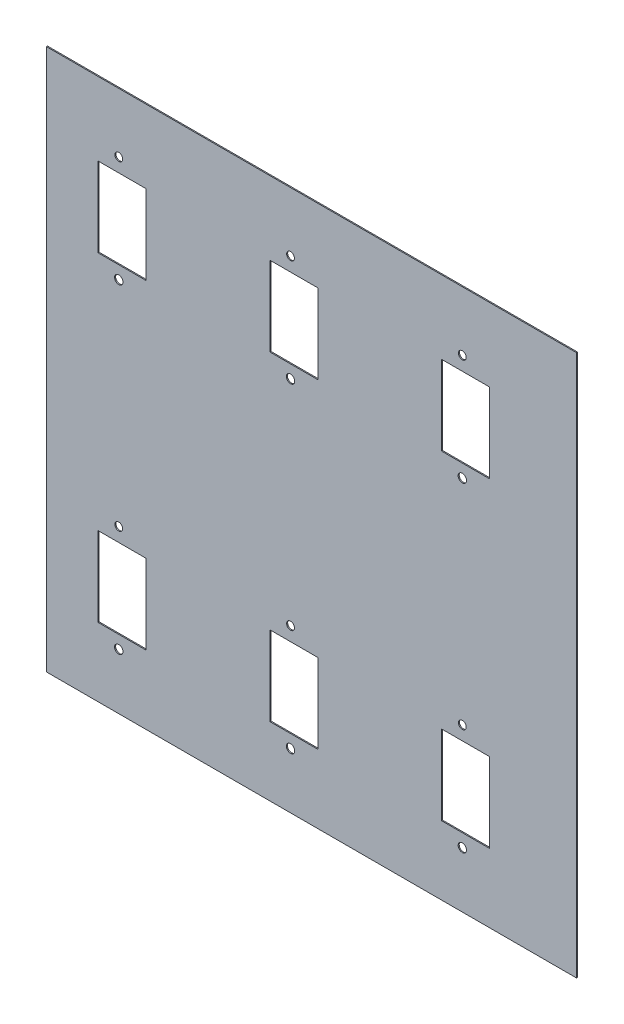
ISO-10303-21;
HEADER;
FILE_DESCRIPTION(('STEP AP214'),'2;1');
FILE_NAME('part.step','',(''),(''),'','','');
FILE_SCHEMA(('AUTOMOTIVE_DESIGN { 1 0 10303 214 1 1 1 1 }'));
ENDSEC;
DATA;
#1=APPLICATION_CONTEXT('core data for automotive mechanical design processes');
#2=APPLICATION_PROTOCOL_DEFINITION('international standard','automotive_design',2000,#1);
#3=PRODUCT_CONTEXT('',#1,'mechanical');
#4=PRODUCT('Part','Part','',(#3));
#5=PRODUCT_RELATED_PRODUCT_CATEGORY('part','',(#4));
#6=PRODUCT_DEFINITION_FORMATION('','',#4);
#7=PRODUCT_DEFINITION_CONTEXT('part definition',#1,'design');
#8=PRODUCT_DEFINITION('design','',#6,#7);
#9=PRODUCT_DEFINITION_SHAPE('','',#8);
#10=(LENGTH_UNIT() NAMED_UNIT(*) SI_UNIT(.MILLI.,.METRE.));
#11=(NAMED_UNIT(*) PLANE_ANGLE_UNIT() SI_UNIT($,.RADIAN.));
#12=(NAMED_UNIT(*) SI_UNIT($,.STERADIAN.) SOLID_ANGLE_UNIT());
#13=UNCERTAINTY_MEASURE_WITH_UNIT(LENGTH_MEASURE(1.E-05),#10,'distance_accuracy_value','');
#14=(GEOMETRIC_REPRESENTATION_CONTEXT(3) GLOBAL_UNCERTAINTY_ASSIGNED_CONTEXT((#13)) GLOBAL_UNIT_ASSIGNED_CONTEXT((#10,
#11,#12)) REPRESENTATION_CONTEXT('',''));
#15=CARTESIAN_POINT('',(0.,0.,0.));
#16=DIRECTION('',(0.,0.,1.));
#17=DIRECTION('',(1.,0.,0.));
#18=AXIS2_PLACEMENT_3D('',#15,#16,#17);
#19=CARTESIAN_POINT('',(-292.934613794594,286.400756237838,2.54));
#20=DIRECTION('',(1.,0.,0.));
#21=DIRECTION('',(0.,0.,-1.));
#22=AXIS2_PLACEMENT_3D('',#19,#20,#21);
#23=PLANE('',#22);
#24=DIRECTION('',(0.,-1.,0.));
#25=VECTOR('',#24,1.);
#26=CARTESIAN_POINT('',(-292.934613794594,286.400756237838,0.));
#27=LINE('',#26,#25);
#28=CARTESIAN_POINT('',(-292.934613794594,286.400756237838,0.));
#29=VERTEX_POINT('',#28);
#30=CARTESIAN_POINT('',(-292.934613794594,-1002.79142159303,0.));
#31=VERTEX_POINT('',#30);
#32=EDGE_CURVE('E297',#29,#31,#27,.T.);
#33=ORIENTED_EDGE('',*,*,#32,.T.);
#34=DIRECTION('',(0.,0.,-1.));
#35=VECTOR('',#34,1.);
#36=CARTESIAN_POINT('',(-292.934613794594,-1002.79142159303,2.54));
#37=LINE('',#36,#35);
#38=CARTESIAN_POINT('',(-292.934613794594,-1002.79142159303,2.54));
#39=VERTEX_POINT('',#38);
#40=EDGE_CURVE('E330',#39,#31,#37,.T.);
#41=ORIENTED_EDGE('',*,*,#40,.F.);
#42=DIRECTION('',(0.,-1.,0.));
#43=VECTOR('',#42,1.);
#44=CARTESIAN_POINT('',(-292.934613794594,286.400756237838,2.54));
#45=LINE('',#44,#43);
#46=CARTESIAN_POINT('',(-292.934613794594,286.400756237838,2.54));
#47=VERTEX_POINT('',#46);
#48=EDGE_CURVE('E304',#47,#39,#45,.T.);
#49=ORIENTED_EDGE('',*,*,#48,.F.);
#50=DIRECTION('',(0.,0.,-1.));
#51=VECTOR('',#50,1.);
#52=CARTESIAN_POINT('',(-292.934613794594,286.400756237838,2.54));
#53=LINE('',#52,#51);
#54=EDGE_CURVE('E314',#47,#29,#53,.T.);
#55=ORIENTED_EDGE('',*,*,#54,.T.);
#56=EDGE_LOOP('',(#33,#41,#49,#55));
#57=FACE_BOUND('',#56,.T.);
#58=ADVANCED_FACE('F30',(#57),#23,.F.);
#59=CARTESIAN_POINT('',(-292.934613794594,-1002.79142159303,2.54));
#60=DIRECTION('',(0.,1.,0.));
#61=DIRECTION('',(0.,0.,1.));
#62=AXIS2_PLACEMENT_3D('',#59,#60,#61);
#63=PLANE('',#62);
#64=DIRECTION('',(1.,0.,0.));
#65=VECTOR('',#64,1.);
#66=CARTESIAN_POINT('',(-292.934613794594,-1002.79142159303,0.));
#67=LINE('',#66,#65);
#68=CARTESIAN_POINT('',(969.034750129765,-1002.79142159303,0.));
#69=VERTEX_POINT('',#68);
#70=EDGE_CURVE('E317',#31,#69,#67,.T.);
#71=ORIENTED_EDGE('',*,*,#70,.T.);
#72=DIRECTION('',(0.,0.,-1.));
#73=VECTOR('',#72,1.);
#74=CARTESIAN_POINT('',(969.034750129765,-1002.79142159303,2.54));
#75=LINE('',#74,#73);
#76=CARTESIAN_POINT('',(969.034750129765,-1002.79142159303,2.54));
#77=VERTEX_POINT('',#76);
#78=EDGE_CURVE('E327',#77,#69,#75,.T.);
#79=ORIENTED_EDGE('',*,*,#78,.F.);
#80=DIRECTION('',(1.,0.,0.));
#81=VECTOR('',#80,1.);
#82=CARTESIAN_POINT('',(-292.934613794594,-1002.79142159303,2.54));
#83=LINE('',#82,#81);
#84=EDGE_CURVE('E307',#39,#77,#83,.T.);
#85=ORIENTED_EDGE('',*,*,#84,.F.);
#86=ORIENTED_EDGE('',*,*,#40,.T.);
#87=EDGE_LOOP('',(#71,#79,#85,#86));
#88=FACE_BOUND('',#87,.T.);
#89=ADVANCED_FACE('F476',(#88),#63,.F.);
#90=CARTESIAN_POINT('',(969.034750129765,286.400756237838,2.54));
#91=DIRECTION('',(-1.,0.,0.));
#92=DIRECTION('',(0.,-1.,0.));
#93=AXIS2_PLACEMENT_3D('',#90,#91,#92);
#94=PLANE('',#93);
#95=DIRECTION('',(0.,1.,0.));
#96=VECTOR('',#95,1.);
#97=CARTESIAN_POINT('',(969.034750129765,286.400756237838,0.));
#98=LINE('',#97,#96);
#99=CARTESIAN_POINT('',(969.034750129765,286.400756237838,0.));
#100=VERTEX_POINT('',#99);
#101=EDGE_CURVE('E319',#69,#100,#98,.T.);
#102=ORIENTED_EDGE('',*,*,#101,.T.);
#103=DIRECTION('',(0.,0.,-1.));
#104=VECTOR('',#103,1.);
#105=CARTESIAN_POINT('',(969.034750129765,286.400756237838,2.54));
#106=LINE('',#105,#104);
#107=CARTESIAN_POINT('',(969.034750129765,286.400756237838,2.54));
#108=VERTEX_POINT('',#107);
#109=EDGE_CURVE('E324',#108,#100,#106,.T.);
#110=ORIENTED_EDGE('',*,*,#109,.F.);
#111=DIRECTION('',(0.,1.,0.));
#112=VECTOR('',#111,1.);
#113=CARTESIAN_POINT('',(969.034750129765,286.400756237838,2.54));
#114=LINE('',#113,#112);
#115=EDGE_CURVE('E310',#77,#108,#114,.T.);
#116=ORIENTED_EDGE('',*,*,#115,.F.);
#117=ORIENTED_EDGE('',*,*,#78,.T.);
#118=EDGE_LOOP('',(#102,#110,#116,#117));
#119=FACE_BOUND('',#118,.T.);
#120=ADVANCED_FACE('F482',(#119),#94,.F.);
#121=CARTESIAN_POINT('',(-292.934613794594,286.400756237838,2.54));
#122=DIRECTION('',(0.,-1.,0.));
#123=DIRECTION('',(0.,0.,-1.));
#124=AXIS2_PLACEMENT_3D('',#121,#122,#123);
#125=PLANE('',#124);
#126=DIRECTION('',(-1.,0.,0.));
#127=VECTOR('',#126,1.);
#128=CARTESIAN_POINT('',(-292.934613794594,286.400756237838,0.));
#129=LINE('',#128,#127);
#130=EDGE_CURVE('E308',#100,#29,#129,.T.);
#131=ORIENTED_EDGE('',*,*,#130,.T.);
#132=ORIENTED_EDGE('',*,*,#54,.F.);
#133=DIRECTION('',(-1.,0.,0.));
#134=VECTOR('',#133,1.);
#135=CARTESIAN_POINT('',(-292.934613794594,286.400756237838,2.54));
#136=LINE('',#135,#134);
#137=EDGE_CURVE('E312',#108,#47,#136,.T.);
#138=ORIENTED_EDGE('',*,*,#137,.F.);
#139=ORIENTED_EDGE('',*,*,#109,.T.);
#140=EDGE_LOOP('',(#131,#132,#138,#139));
#141=FACE_BOUND('',#140,.T.);
#142=ADVANCED_FACE('F548',(#141),#125,.F.);
#143=CARTESIAN_POINT('',(-292.934613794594,-1002.79142159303,2.54));
#144=DIRECTION('',(0.,0.,1.));
#145=DIRECTION('',(1.,0.,0.));
#146=AXIS2_PLACEMENT_3D('',#143,#144,#145);
#147=PLANE('',#146);
#148=CARTESIAN_POINT('',(697.196630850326,-870.095305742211,2.54));
#149=DIRECTION('',(0.,0.,1.));
#150=DIRECTION('',(1.,0.,0.));
#151=AXIS2_PLACEMENT_3D('',#148,#149,#150);
#152=CIRCLE('',#151,9.95883906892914);
#153=CARTESIAN_POINT('',(707.155469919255,-870.095305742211,2.54));
#154=VERTEX_POINT('',#153);
#155=EDGE_CURVE('E906',#154,#154,#152,.T.);
#156=ORIENTED_EDGE('',*,*,#155,.F.);
#157=EDGE_LOOP('',(#156));
#158=FACE_BOUND('',#157,.T.);
#159=CARTESIAN_POINT('',(697.196630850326,-616.900953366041,2.54));
#160=DIRECTION('',(0.,0.,1.));
#161=DIRECTION('',(1.,0.,0.));
#162=AXIS2_PLACEMENT_3D('',#159,#160,#161);
#163=CIRCLE('',#162,9.33473781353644);
#164=CARTESIAN_POINT('',(706.531368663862,-616.900953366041,2.54));
#165=VERTEX_POINT('',#164);
#166=EDGE_CURVE('E908',#165,#165,#163,.T.);
#167=ORIENTED_EDGE('',*,*,#166,.F.);
#168=EDGE_LOOP('',(#167));
#169=FACE_BOUND('',#168,.T.);
#170=CARTESIAN_POINT('',(288.256630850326,-870.095305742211,2.54));
#171=DIRECTION('',(0.,0.,1.));
#172=DIRECTION('',(1.,0.,0.));
#173=AXIS2_PLACEMENT_3D('',#170,#171,#172);
#174=CIRCLE('',#173,9.95883906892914);
#175=CARTESIAN_POINT('',(298.215469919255,-870.095305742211,2.54));
#176=VERTEX_POINT('',#175);
#177=EDGE_CURVE('E914',#176,#176,#174,.T.);
#178=ORIENTED_EDGE('',*,*,#177,.F.);
#179=EDGE_LOOP('',(#178));
#180=FACE_BOUND('',#179,.T.);
#181=CARTESIAN_POINT('',(288.256630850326,-616.900953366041,2.54));
#182=DIRECTION('',(0.,0.,1.));
#183=DIRECTION('',(1.,0.,0.));
#184=AXIS2_PLACEMENT_3D('',#181,#182,#183);
#185=CIRCLE('',#184,9.33473781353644);
#186=CARTESIAN_POINT('',(297.591368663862,-616.900953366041,2.54));
#187=VERTEX_POINT('',#186);
#188=EDGE_CURVE('E920',#187,#187,#185,.T.);
#189=ORIENTED_EDGE('',*,*,#188,.F.);
#190=EDGE_LOOP('',(#189));
#191=FACE_BOUND('',#190,.T.);
#192=CARTESIAN_POINT('',(-120.683369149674,-870.095305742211,2.54));
#193=DIRECTION('',(0.,0.,1.));
#194=DIRECTION('',(1.,0.,0.));
#195=AXIS2_PLACEMENT_3D('',#192,#193,#194);
#196=CIRCLE('',#195,9.95883906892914);
#197=CARTESIAN_POINT('',(-110.724530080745,-870.095305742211,2.54));
#198=VERTEX_POINT('',#197);
#199=EDGE_CURVE('E926',#198,#198,#196,.T.);
#200=ORIENTED_EDGE('',*,*,#199,.F.);
#201=EDGE_LOOP('',(#200));
#202=FACE_BOUND('',#201,.T.);
#203=CARTESIAN_POINT('',(-120.683369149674,-616.900953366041,2.54));
#204=DIRECTION('',(0.,0.,1.));
#205=DIRECTION('',(1.,0.,0.));
#206=AXIS2_PLACEMENT_3D('',#203,#204,#205);
#207=CIRCLE('',#206,9.33473781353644);
#208=CARTESIAN_POINT('',(-111.348631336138,-616.900953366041,2.54));
#209=VERTEX_POINT('',#208);
#210=EDGE_CURVE('E932',#209,#209,#207,.T.);
#211=ORIENTED_EDGE('',*,*,#210,.F.);
#212=EDGE_LOOP('',(#211));
#213=FACE_BOUND('',#212,.T.);
#214=CARTESIAN_POINT('',(697.196630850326,-108.095305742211,2.54));
#215=DIRECTION('',(0.,0.,1.));
#216=DIRECTION('',(1.,0.,0.));
#217=AXIS2_PLACEMENT_3D('',#214,#215,#216);
#218=CIRCLE('',#217,9.95883906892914);
#219=CARTESIAN_POINT('',(707.155469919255,-108.095305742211,2.54));
#220=VERTEX_POINT('',#219);
#221=EDGE_CURVE('E938',#220,#220,#218,.T.);
#222=ORIENTED_EDGE('',*,*,#221,.F.);
#223=EDGE_LOOP('',(#222));
#224=FACE_BOUND('',#223,.T.);
#225=CARTESIAN_POINT('',(697.196630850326,145.099046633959,2.54));
#226=DIRECTION('',(0.,0.,1.));
#227=DIRECTION('',(1.,0.,0.));
#228=AXIS2_PLACEMENT_3D('',#225,#226,#227);
#229=CIRCLE('',#228,9.33473781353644);
#230=CARTESIAN_POINT('',(706.531368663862,145.099046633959,2.54));
#231=VERTEX_POINT('',#230);
#232=EDGE_CURVE('E944',#231,#231,#229,.T.);
#233=ORIENTED_EDGE('',*,*,#232,.F.);
#234=EDGE_LOOP('',(#233));
#235=FACE_BOUND('',#234,.T.);
#236=CARTESIAN_POINT('',(288.256630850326,-108.095305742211,2.54));
#237=DIRECTION('',(0.,0.,1.));
#238=DIRECTION('',(1.,0.,0.));
#239=AXIS2_PLACEMENT_3D('',#236,#237,#238);
#240=CIRCLE('',#239,9.95883906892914);
#241=CARTESIAN_POINT('',(298.215469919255,-108.095305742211,2.54));
#242=VERTEX_POINT('',#241);
#243=EDGE_CURVE('E950',#242,#242,#240,.T.);
#244=ORIENTED_EDGE('',*,*,#243,.F.);
#245=EDGE_LOOP('',(#244));
#246=FACE_BOUND('',#245,.T.);
#247=CARTESIAN_POINT('',(288.256630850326,145.099046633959,2.54));
#248=DIRECTION('',(0.,0.,1.));
#249=DIRECTION('',(1.,0.,0.));
#250=AXIS2_PLACEMENT_3D('',#247,#248,#249);
#251=CIRCLE('',#250,9.33473781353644);
#252=CARTESIAN_POINT('',(297.591368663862,145.099046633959,2.54));
#253=VERTEX_POINT('',#252);
#254=EDGE_CURVE('E956',#253,#253,#251,.T.);
#255=ORIENTED_EDGE('',*,*,#254,.F.);
#256=EDGE_LOOP('',(#255));
#257=FACE_BOUND('',#256,.T.);
#258=DIRECTION('',(0.,-1.,0.));
#259=VECTOR('',#258,1.);
#260=CARTESIAN_POINT('',(-170.073739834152,-649.903385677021,2.54));
#261=LINE('',#260,#259);
#262=CARTESIAN_POINT('',(-170.073739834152,-649.903385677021,2.54));
#263=VERTEX_POINT('',#262);
#264=CARTESIAN_POINT('',(-170.073739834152,-839.186162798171,2.54));
#265=VERTEX_POINT('',#264);
#266=EDGE_CURVE('E254',#263,#265,#261,.T.);
#267=ORIENTED_EDGE('',*,*,#266,.F.);
#268=DIRECTION('',(-1.,0.,0.));
#269=VECTOR('',#268,1.);
#270=CARTESIAN_POINT('',(-170.073739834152,-649.903385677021,2.54));
#271=LINE('',#270,#269);
#272=CARTESIAN_POINT('',(-55.6475194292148,-649.903385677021,2.54));
#273=VERTEX_POINT('',#272);
#274=EDGE_CURVE('E240',#273,#263,#271,.T.);
#275=ORIENTED_EDGE('',*,*,#274,.F.);
#276=DIRECTION('',(0.,1.,0.));
#277=VECTOR('',#276,1.);
#278=CARTESIAN_POINT('',(-55.6475194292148,-649.903385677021,2.54));
#279=LINE('',#278,#277);
#280=CARTESIAN_POINT('',(-55.6475194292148,-839.186162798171,2.54));
#281=VERTEX_POINT('',#280);
#282=EDGE_CURVE('E232',#281,#273,#279,.T.);
#283=ORIENTED_EDGE('',*,*,#282,.F.);
#284=DIRECTION('',(1.,0.,0.));
#285=VECTOR('',#284,1.);
#286=CARTESIAN_POINT('',(-170.073739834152,-839.186162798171,2.54));
#287=LINE('',#286,#285);
#288=EDGE_CURVE('E217',#265,#281,#287,.T.);
#289=ORIENTED_EDGE('',*,*,#288,.F.);
#290=EDGE_LOOP('',(#267,#275,#283,#289));
#291=FACE_BOUND('',#290,.T.);
#292=CARTESIAN_POINT('',(-120.683369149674,-108.095305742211,2.54));
#293=DIRECTION('',(0.,0.,1.));
#294=DIRECTION('',(1.,0.,0.));
#295=AXIS2_PLACEMENT_3D('',#292,#293,#294);
#296=CIRCLE('',#295,9.95883906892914);
#297=CARTESIAN_POINT('',(-110.724530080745,-108.095305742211,2.54));
#298=VERTEX_POINT('',#297);
#299=EDGE_CURVE('E259',#298,#298,#296,.T.);
#300=ORIENTED_EDGE('',*,*,#299,.F.);
#301=EDGE_LOOP('',(#300));
#302=FACE_BOUND('',#301,.T.);
#303=CARTESIAN_POINT('',(-120.683369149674,145.099046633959,2.54));
#304=DIRECTION('',(0.,0.,1.));
#305=DIRECTION('',(1.,0.,0.));
#306=AXIS2_PLACEMENT_3D('',#303,#304,#305);
#307=CIRCLE('',#306,9.33473781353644);
#308=CARTESIAN_POINT('',(-111.348631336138,145.099046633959,2.54));
#309=VERTEX_POINT('',#308);
#310=EDGE_CURVE('E263',#309,#309,#307,.T.);
#311=ORIENTED_EDGE('',*,*,#310,.F.);
#312=EDGE_LOOP('',(#311));
#313=FACE_BOUND('',#312,.T.);
#314=DIRECTION('',(0.,-1.,0.));
#315=VECTOR('',#314,1.);
#316=CARTESIAN_POINT('',(-170.073739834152,112.096614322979,2.54));
#317=LINE('',#316,#315);
#318=CARTESIAN_POINT('',(-170.073739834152,112.096614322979,2.54));
#319=VERTEX_POINT('',#318);
#320=CARTESIAN_POINT('',(-170.073739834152,-77.1861627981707,2.54));
#321=VERTEX_POINT('',#320);
#322=EDGE_CURVE('E269',#319,#321,#317,.T.);
#323=ORIENTED_EDGE('',*,*,#322,.F.);
#324=DIRECTION('',(-1.,0.,0.));
#325=VECTOR('',#324,1.);
#326=CARTESIAN_POINT('',(-170.073739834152,112.096614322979,2.54));
#327=LINE('',#326,#325);
#328=CARTESIAN_POINT('',(-55.6475194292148,112.096614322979,2.54));
#329=VERTEX_POINT('',#328);
#330=EDGE_CURVE('E276',#329,#319,#327,.T.);
#331=ORIENTED_EDGE('',*,*,#330,.F.);
#332=DIRECTION('',(0.,1.,0.));
#333=VECTOR('',#332,1.);
#334=CARTESIAN_POINT('',(-55.6475194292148,112.096614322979,2.54));
#335=LINE('',#334,#333);
#336=CARTESIAN_POINT('',(-55.6475194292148,-77.1861627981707,2.54));
#337=VERTEX_POINT('',#336);
#338=EDGE_CURVE('E290',#337,#329,#335,.T.);
#339=ORIENTED_EDGE('',*,*,#338,.F.);
#340=DIRECTION('',(1.,0.,0.));
#341=VECTOR('',#340,1.);
#342=CARTESIAN_POINT('',(-170.073739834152,-77.1861627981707,2.54));
#343=LINE('',#342,#341);
#344=EDGE_CURVE('E287',#321,#337,#343,.T.);
#345=ORIENTED_EDGE('',*,*,#344,.F.);
#346=EDGE_LOOP('',(#323,#331,#339,#345));
#347=FACE_BOUND('',#346,.T.);
#348=ORIENTED_EDGE('',*,*,#48,.T.);
#349=ORIENTED_EDGE('',*,*,#84,.T.);
#350=ORIENTED_EDGE('',*,*,#115,.T.);
#351=ORIENTED_EDGE('',*,*,#137,.T.);
#352=EDGE_LOOP('',(#348,#349,#350,#351));
#353=FACE_BOUND('',#352,.T.);
#354=DIRECTION('',(0.,-1.,0.));
#355=VECTOR('',#354,1.);
#356=CARTESIAN_POINT('',(238.866260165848,112.096614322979,2.54));
#357=LINE('',#356,#355);
#358=CARTESIAN_POINT('',(238.866260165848,112.096614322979,2.54));
#359=VERTEX_POINT('',#358);
#360=CARTESIAN_POINT('',(238.866260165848,-77.1861627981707,2.54));
#361=VERTEX_POINT('',#360);
#362=EDGE_CURVE('E333',#359,#361,#357,.T.);
#363=ORIENTED_EDGE('',*,*,#362,.F.);
#364=DIRECTION('',(-1.,0.,0.));
#365=VECTOR('',#364,1.);
#366=CARTESIAN_POINT('',(238.866260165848,112.096614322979,2.54));
#367=LINE('',#366,#365);
#368=CARTESIAN_POINT('',(353.292480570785,112.096614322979,2.54));
#369=VERTEX_POINT('',#368);
#370=EDGE_CURVE('E335',#369,#359,#367,.T.);
#371=ORIENTED_EDGE('',*,*,#370,.F.);
#372=DIRECTION('',(0.,1.,0.));
#373=VECTOR('',#372,1.);
#374=CARTESIAN_POINT('',(353.292480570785,112.096614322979,2.54));
#375=LINE('',#374,#373);
#376=CARTESIAN_POINT('',(353.292480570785,-77.1861627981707,2.54));
#377=VERTEX_POINT('',#376);
#378=EDGE_CURVE('E338',#377,#369,#375,.T.);
#379=ORIENTED_EDGE('',*,*,#378,.F.);
#380=DIRECTION('',(1.,0.,0.));
#381=VECTOR('',#380,1.);
#382=CARTESIAN_POINT('',(238.866260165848,-77.1861627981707,2.54));
#383=LINE('',#382,#381);
#384=EDGE_CURVE('E341',#361,#377,#383,.T.);
#385=ORIENTED_EDGE('',*,*,#384,.F.);
#386=EDGE_LOOP('',(#363,#371,#379,#385));
#387=FACE_BOUND('',#386,.T.);
#388=DIRECTION('',(0.,-1.,0.));
#389=VECTOR('',#388,1.);
#390=CARTESIAN_POINT('',(238.866260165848,-649.903385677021,2.54));
#391=LINE('',#390,#389);
#392=CARTESIAN_POINT('',(238.866260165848,-649.903385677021,2.54));
#393=VERTEX_POINT('',#392);
#394=CARTESIAN_POINT('',(238.866260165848,-839.186162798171,2.54));
#395=VERTEX_POINT('',#394);
#396=EDGE_CURVE('E365',#393,#395,#391,.T.);
#397=ORIENTED_EDGE('',*,*,#396,.F.);
#398=DIRECTION('',(-1.,0.,0.));
#399=VECTOR('',#398,1.);
#400=CARTESIAN_POINT('',(238.866260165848,-649.903385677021,2.54));
#401=LINE('',#400,#399);
#402=CARTESIAN_POINT('',(353.292480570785,-649.903385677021,2.54));
#403=VERTEX_POINT('',#402);
#404=EDGE_CURVE('E367',#403,#393,#401,.T.);
#405=ORIENTED_EDGE('',*,*,#404,.F.);
#406=DIRECTION('',(0.,1.,0.));
#407=VECTOR('',#406,1.);
#408=CARTESIAN_POINT('',(353.292480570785,-649.903385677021,2.54));
#409=LINE('',#408,#407);
#410=CARTESIAN_POINT('',(353.292480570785,-839.186162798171,2.54));
#411=VERTEX_POINT('',#410);
#412=EDGE_CURVE('E370',#411,#403,#409,.T.);
#413=ORIENTED_EDGE('',*,*,#412,.F.);
#414=DIRECTION('',(1.,0.,0.));
#415=VECTOR('',#414,1.);
#416=CARTESIAN_POINT('',(238.866260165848,-839.186162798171,2.54));
#417=LINE('',#416,#415);
#418=EDGE_CURVE('E373',#395,#411,#417,.T.);
#419=ORIENTED_EDGE('',*,*,#418,.F.);
#420=EDGE_LOOP('',(#397,#405,#413,#419));
#421=FACE_BOUND('',#420,.T.);
#422=DIRECTION('',(0.,-1.,0.));
#423=VECTOR('',#422,1.);
#424=CARTESIAN_POINT('',(647.806260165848,112.096614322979,2.54));
#425=LINE('',#424,#423);
#426=CARTESIAN_POINT('',(647.806260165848,112.096614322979,2.54));
#427=VERTEX_POINT('',#426);
#428=CARTESIAN_POINT('',(647.806260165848,-77.1861627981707,2.54));
#429=VERTEX_POINT('',#428);
#430=EDGE_CURVE('E397',#427,#429,#425,.T.);
#431=ORIENTED_EDGE('',*,*,#430,.F.);
#432=DIRECTION('',(-1.,0.,0.));
#433=VECTOR('',#432,1.);
#434=CARTESIAN_POINT('',(647.806260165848,112.096614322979,2.54));
#435=LINE('',#434,#433);
#436=CARTESIAN_POINT('',(762.232480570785,112.096614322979,2.54));
#437=VERTEX_POINT('',#436);
#438=EDGE_CURVE('E399',#437,#427,#435,.T.);
#439=ORIENTED_EDGE('',*,*,#438,.F.);
#440=DIRECTION('',(0.,1.,0.));
#441=VECTOR('',#440,1.);
#442=CARTESIAN_POINT('',(762.232480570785,112.096614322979,2.54));
#443=LINE('',#442,#441);
#444=CARTESIAN_POINT('',(762.232480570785,-77.1861627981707,2.54));
#445=VERTEX_POINT('',#444);
#446=EDGE_CURVE('E402',#445,#437,#443,.T.);
#447=ORIENTED_EDGE('',*,*,#446,.F.);
#448=DIRECTION('',(1.,0.,0.));
#449=VECTOR('',#448,1.);
#450=CARTESIAN_POINT('',(647.806260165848,-77.1861627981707,2.54));
#451=LINE('',#450,#449);
#452=EDGE_CURVE('E405',#429,#445,#451,.T.);
#453=ORIENTED_EDGE('',*,*,#452,.F.);
#454=EDGE_LOOP('',(#431,#439,#447,#453));
#455=FACE_BOUND('',#454,.T.);
#456=DIRECTION('',(0.,-1.,0.));
#457=VECTOR('',#456,1.);
#458=CARTESIAN_POINT('',(647.806260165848,-649.903385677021,2.54));
#459=LINE('',#458,#457);
#460=CARTESIAN_POINT('',(647.806260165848,-649.903385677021,2.54));
#461=VERTEX_POINT('',#460);
#462=CARTESIAN_POINT('',(647.806260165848,-839.186162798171,2.54));
#463=VERTEX_POINT('',#462);
#464=EDGE_CURVE('E429',#461,#463,#459,.T.);
#465=ORIENTED_EDGE('',*,*,#464,.F.);
#466=DIRECTION('',(-1.,0.,0.));
#467=VECTOR('',#466,1.);
#468=CARTESIAN_POINT('',(647.806260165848,-649.903385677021,2.54));
#469=LINE('',#468,#467);
#470=CARTESIAN_POINT('',(762.232480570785,-649.903385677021,2.54));
#471=VERTEX_POINT('',#470);
#472=EDGE_CURVE('E431',#471,#461,#469,.T.);
#473=ORIENTED_EDGE('',*,*,#472,.F.);
#474=DIRECTION('',(0.,1.,0.));
#475=VECTOR('',#474,1.);
#476=CARTESIAN_POINT('',(762.232480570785,-649.903385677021,2.54));
#477=LINE('',#476,#475);
#478=CARTESIAN_POINT('',(762.232480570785,-839.186162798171,2.54));
#479=VERTEX_POINT('',#478);
#480=EDGE_CURVE('E434',#479,#471,#477,.T.);
#481=ORIENTED_EDGE('',*,*,#480,.F.);
#482=DIRECTION('',(1.,0.,0.));
#483=VECTOR('',#482,1.);
#484=CARTESIAN_POINT('',(647.806260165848,-839.186162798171,2.54));
#485=LINE('',#484,#483);
#486=EDGE_CURVE('E437',#463,#479,#485,.T.);
#487=ORIENTED_EDGE('',*,*,#486,.F.);
#488=EDGE_LOOP('',(#465,#473,#481,#487));
#489=FACE_BOUND('',#488,.T.);
#490=ADVANCED_FACE('F238',(#158,#169,#180,#191,#202,#213,#224,#235,#246,#257,#291,#302,#313,
#347,#353,#387,#421,#455,#489),#147,.T.);
#491=CARTESIAN_POINT('',(-292.934613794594,-1002.79142159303,0.));
#492=DIRECTION('',(0.,0.,1.));
#493=DIRECTION('',(1.,0.,0.));
#494=AXIS2_PLACEMENT_3D('',#491,#492,#493);
#495=PLANE('',#494);
#496=CARTESIAN_POINT('',(697.196630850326,-870.095305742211,0.));
#497=DIRECTION('',(0.,0.,1.));
#498=DIRECTION('',(1.,0.,0.));
#499=AXIS2_PLACEMENT_3D('',#496,#497,#498);
#500=CIRCLE('',#499,9.95883906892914);
#501=CARTESIAN_POINT('',(707.155469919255,-870.095305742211,0.));
#502=VERTEX_POINT('',#501);
#503=EDGE_CURVE('E904',#502,#502,#500,.T.);
#504=ORIENTED_EDGE('',*,*,#503,.T.);
#505=EDGE_LOOP('',(#504));
#506=FACE_BOUND('',#505,.T.);
#507=CARTESIAN_POINT('',(697.196630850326,-616.900953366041,0.));
#508=DIRECTION('',(0.,0.,1.));
#509=DIRECTION('',(1.,0.,0.));
#510=AXIS2_PLACEMENT_3D('',#507,#508,#509);
#511=CIRCLE('',#510,9.33473781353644);
#512=CARTESIAN_POINT('',(706.531368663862,-616.900953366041,0.));
#513=VERTEX_POINT('',#512);
#514=EDGE_CURVE('E911',#513,#513,#511,.T.);
#515=ORIENTED_EDGE('',*,*,#514,.T.);
#516=EDGE_LOOP('',(#515));
#517=FACE_BOUND('',#516,.T.);
#518=CARTESIAN_POINT('',(288.256630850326,-870.095305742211,0.));
#519=DIRECTION('',(0.,0.,1.));
#520=DIRECTION('',(1.,0.,0.));
#521=AXIS2_PLACEMENT_3D('',#518,#519,#520);
#522=CIRCLE('',#521,9.95883906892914);
#523=CARTESIAN_POINT('',(298.215469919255,-870.095305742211,0.));
#524=VERTEX_POINT('',#523);
#525=EDGE_CURVE('E917',#524,#524,#522,.T.);
#526=ORIENTED_EDGE('',*,*,#525,.T.);
#527=EDGE_LOOP('',(#526));
#528=FACE_BOUND('',#527,.T.);
#529=CARTESIAN_POINT('',(288.256630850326,-616.900953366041,0.));
#530=DIRECTION('',(0.,0.,1.));
#531=DIRECTION('',(1.,0.,0.));
#532=AXIS2_PLACEMENT_3D('',#529,#530,#531);
#533=CIRCLE('',#532,9.33473781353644);
#534=CARTESIAN_POINT('',(297.591368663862,-616.900953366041,0.));
#535=VERTEX_POINT('',#534);
#536=EDGE_CURVE('E923',#535,#535,#533,.T.);
#537=ORIENTED_EDGE('',*,*,#536,.T.);
#538=EDGE_LOOP('',(#537));
#539=FACE_BOUND('',#538,.T.);
#540=CARTESIAN_POINT('',(-120.683369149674,-870.095305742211,0.));
#541=DIRECTION('',(0.,0.,1.));
#542=DIRECTION('',(1.,0.,0.));
#543=AXIS2_PLACEMENT_3D('',#540,#541,#542);
#544=CIRCLE('',#543,9.95883906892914);
#545=CARTESIAN_POINT('',(-110.724530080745,-870.095305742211,0.));
#546=VERTEX_POINT('',#545);
#547=EDGE_CURVE('E929',#546,#546,#544,.T.);
#548=ORIENTED_EDGE('',*,*,#547,.T.);
#549=EDGE_LOOP('',(#548));
#550=FACE_BOUND('',#549,.T.);
#551=CARTESIAN_POINT('',(-120.683369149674,-616.900953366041,0.));
#552=DIRECTION('',(0.,0.,1.));
#553=DIRECTION('',(1.,0.,0.));
#554=AXIS2_PLACEMENT_3D('',#551,#552,#553);
#555=CIRCLE('',#554,9.33473781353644);
#556=CARTESIAN_POINT('',(-111.348631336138,-616.900953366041,0.));
#557=VERTEX_POINT('',#556);
#558=EDGE_CURVE('E935',#557,#557,#555,.T.);
#559=ORIENTED_EDGE('',*,*,#558,.T.);
#560=EDGE_LOOP('',(#559));
#561=FACE_BOUND('',#560,.T.);
#562=CARTESIAN_POINT('',(697.196630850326,-108.095305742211,0.));
#563=DIRECTION('',(0.,0.,1.));
#564=DIRECTION('',(1.,0.,0.));
#565=AXIS2_PLACEMENT_3D('',#562,#563,#564);
#566=CIRCLE('',#565,9.95883906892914);
#567=CARTESIAN_POINT('',(707.155469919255,-108.095305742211,0.));
#568=VERTEX_POINT('',#567);
#569=EDGE_CURVE('E941',#568,#568,#566,.T.);
#570=ORIENTED_EDGE('',*,*,#569,.T.);
#571=EDGE_LOOP('',(#570));
#572=FACE_BOUND('',#571,.T.);
#573=CARTESIAN_POINT('',(697.196630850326,145.099046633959,0.));
#574=DIRECTION('',(0.,0.,1.));
#575=DIRECTION('',(1.,0.,0.));
#576=AXIS2_PLACEMENT_3D('',#573,#574,#575);
#577=CIRCLE('',#576,9.33473781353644);
#578=CARTESIAN_POINT('',(706.531368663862,145.099046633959,0.));
#579=VERTEX_POINT('',#578);
#580=EDGE_CURVE('E947',#579,#579,#577,.T.);
#581=ORIENTED_EDGE('',*,*,#580,.T.);
#582=EDGE_LOOP('',(#581));
#583=FACE_BOUND('',#582,.T.);
#584=CARTESIAN_POINT('',(288.256630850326,-108.095305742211,0.));
#585=DIRECTION('',(0.,0.,1.));
#586=DIRECTION('',(1.,0.,0.));
#587=AXIS2_PLACEMENT_3D('',#584,#585,#586);
#588=CIRCLE('',#587,9.95883906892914);
#589=CARTESIAN_POINT('',(298.215469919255,-108.095305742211,0.));
#590=VERTEX_POINT('',#589);
#591=EDGE_CURVE('E953',#590,#590,#588,.T.);
#592=ORIENTED_EDGE('',*,*,#591,.T.);
#593=EDGE_LOOP('',(#592));
#594=FACE_BOUND('',#593,.T.);
#595=CARTESIAN_POINT('',(288.256630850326,145.099046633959,0.));
#596=DIRECTION('',(0.,0.,1.));
#597=DIRECTION('',(1.,0.,0.));
#598=AXIS2_PLACEMENT_3D('',#595,#596,#597);
#599=CIRCLE('',#598,9.33473781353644);
#600=CARTESIAN_POINT('',(297.591368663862,145.099046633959,0.));
#601=VERTEX_POINT('',#600);
#602=EDGE_CURVE('E228',#601,#601,#599,.T.);
#603=ORIENTED_EDGE('',*,*,#602,.T.);
#604=EDGE_LOOP('',(#603));
#605=FACE_BOUND('',#604,.T.);
#606=DIRECTION('',(-1.,0.,0.));
#607=VECTOR('',#606,1.);
#608=CARTESIAN_POINT('',(-170.073739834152,-649.903385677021,0.));
#609=LINE('',#608,#607);
#610=CARTESIAN_POINT('',(-55.6475194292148,-649.903385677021,0.));
#611=VERTEX_POINT('',#610);
#612=CARTESIAN_POINT('',(-170.073739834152,-649.903385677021,0.));
#613=VERTEX_POINT('',#612);
#614=EDGE_CURVE('E251',#611,#613,#609,.T.);
#615=ORIENTED_EDGE('',*,*,#614,.T.);
#616=DIRECTION('',(0.,-1.,0.));
#617=VECTOR('',#616,1.);
#618=CARTESIAN_POINT('',(-170.073739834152,-649.903385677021,0.));
#619=LINE('',#618,#617);
#620=CARTESIAN_POINT('',(-170.073739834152,-839.186162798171,0.));
#621=VERTEX_POINT('',#620);
#622=EDGE_CURVE('E256',#613,#621,#619,.T.);
#623=ORIENTED_EDGE('',*,*,#622,.T.);
#624=DIRECTION('',(1.,0.,0.));
#625=VECTOR('',#624,1.);
#626=CARTESIAN_POINT('',(-170.073739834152,-839.186162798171,0.));
#627=LINE('',#626,#625);
#628=CARTESIAN_POINT('',(-55.6475194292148,-839.186162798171,0.));
#629=VERTEX_POINT('',#628);
#630=EDGE_CURVE('E227',#621,#629,#627,.T.);
#631=ORIENTED_EDGE('',*,*,#630,.T.);
#632=DIRECTION('',(0.,1.,0.));
#633=VECTOR('',#632,1.);
#634=CARTESIAN_POINT('',(-55.6475194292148,-649.903385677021,0.));
#635=LINE('',#634,#633);
#636=EDGE_CURVE('E235',#629,#611,#635,.T.);
#637=ORIENTED_EDGE('',*,*,#636,.T.);
#638=EDGE_LOOP('',(#615,#623,#631,#637));
#639=FACE_BOUND('',#638,.T.);
#640=CARTESIAN_POINT('',(-120.683369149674,-108.095305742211,0.));
#641=DIRECTION('',(0.,0.,1.));
#642=DIRECTION('',(1.,0.,0.));
#643=AXIS2_PLACEMENT_3D('',#640,#641,#642);
#644=CIRCLE('',#643,9.95883906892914);
#645=CARTESIAN_POINT('',(-110.724530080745,-108.095305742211,0.));
#646=VERTEX_POINT('',#645);
#647=EDGE_CURVE('E260',#646,#646,#644,.T.);
#648=ORIENTED_EDGE('',*,*,#647,.T.);
#649=EDGE_LOOP('',(#648));
#650=FACE_BOUND('',#649,.T.);
#651=CARTESIAN_POINT('',(-120.683369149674,145.099046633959,0.));
#652=DIRECTION('',(0.,0.,1.));
#653=DIRECTION('',(1.,0.,0.));
#654=AXIS2_PLACEMENT_3D('',#651,#652,#653);
#655=CIRCLE('',#654,9.33473781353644);
#656=CARTESIAN_POINT('',(-111.348631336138,145.099046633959,0.));
#657=VERTEX_POINT('',#656);
#658=EDGE_CURVE('E266',#657,#657,#655,.T.);
#659=ORIENTED_EDGE('',*,*,#658,.T.);
#660=EDGE_LOOP('',(#659));
#661=FACE_BOUND('',#660,.T.);
#662=DIRECTION('',(-1.,0.,0.));
#663=VECTOR('',#662,1.);
#664=CARTESIAN_POINT('',(-170.073739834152,112.096614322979,0.));
#665=LINE('',#664,#663);
#666=CARTESIAN_POINT('',(-55.6475194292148,112.096614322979,0.));
#667=VERTEX_POINT('',#666);
#668=CARTESIAN_POINT('',(-170.073739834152,112.096614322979,0.));
#669=VERTEX_POINT('',#668);
#670=EDGE_CURVE('E282',#667,#669,#665,.T.);
#671=ORIENTED_EDGE('',*,*,#670,.T.);
#672=DIRECTION('',(0.,-1.,0.));
#673=VECTOR('',#672,1.);
#674=CARTESIAN_POINT('',(-170.073739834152,112.096614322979,0.));
#675=LINE('',#674,#673);
#676=CARTESIAN_POINT('',(-170.073739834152,-77.1861627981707,0.));
#677=VERTEX_POINT('',#676);
#678=EDGE_CURVE('E272',#669,#677,#675,.T.);
#679=ORIENTED_EDGE('',*,*,#678,.T.);
#680=DIRECTION('',(1.,0.,0.));
#681=VECTOR('',#680,1.);
#682=CARTESIAN_POINT('',(-170.073739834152,-77.1861627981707,0.));
#683=LINE('',#682,#681);
#684=CARTESIAN_POINT('',(-55.6475194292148,-77.1861627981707,0.));
#685=VERTEX_POINT('',#684);
#686=EDGE_CURVE('E275',#677,#685,#683,.T.);
#687=ORIENTED_EDGE('',*,*,#686,.T.);
#688=DIRECTION('',(0.,1.,0.));
#689=VECTOR('',#688,1.);
#690=CARTESIAN_POINT('',(-55.6475194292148,112.096614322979,0.));
#691=LINE('',#690,#689);
#692=EDGE_CURVE('E279',#685,#667,#691,.T.);
#693=ORIENTED_EDGE('',*,*,#692,.T.);
#694=EDGE_LOOP('',(#671,#679,#687,#693));
#695=FACE_BOUND('',#694,.T.);
#696=ORIENTED_EDGE('',*,*,#32,.F.);
#697=ORIENTED_EDGE('',*,*,#130,.F.);
#698=ORIENTED_EDGE('',*,*,#101,.F.);
#699=ORIENTED_EDGE('',*,*,#70,.F.);
#700=EDGE_LOOP('',(#696,#697,#698,#699));
#701=FACE_BOUND('',#700,.T.);
#702=DIRECTION('',(0.,-1.,0.));
#703=VECTOR('',#702,1.);
#704=CARTESIAN_POINT('',(238.866260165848,112.096614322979,0.));
#705=LINE('',#704,#703);
#706=CARTESIAN_POINT('',(238.866260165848,112.096614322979,0.));
#707=VERTEX_POINT('',#706);
#708=CARTESIAN_POINT('',(238.866260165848,-77.1861627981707,0.));
#709=VERTEX_POINT('',#708);
#710=EDGE_CURVE('E344',#707,#709,#705,.T.);
#711=ORIENTED_EDGE('',*,*,#710,.T.);
#712=DIRECTION('',(1.,0.,0.));
#713=VECTOR('',#712,1.);
#714=CARTESIAN_POINT('',(238.866260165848,-77.1861627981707,0.));
#715=LINE('',#714,#713);
#716=CARTESIAN_POINT('',(353.292480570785,-77.1861627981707,0.));
#717=VERTEX_POINT('',#716);
#718=EDGE_CURVE('E346',#709,#717,#715,.T.);
#719=ORIENTED_EDGE('',*,*,#718,.T.);
#720=DIRECTION('',(0.,1.,0.));
#721=VECTOR('',#720,1.);
#722=CARTESIAN_POINT('',(353.292480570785,112.096614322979,0.));
#723=LINE('',#722,#721);
#724=CARTESIAN_POINT('',(353.292480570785,112.096614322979,0.));
#725=VERTEX_POINT('',#724);
#726=EDGE_CURVE('E348',#717,#725,#723,.T.);
#727=ORIENTED_EDGE('',*,*,#726,.T.);
#728=DIRECTION('',(-1.,0.,0.));
#729=VECTOR('',#728,1.);
#730=CARTESIAN_POINT('',(238.866260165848,112.096614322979,0.));
#731=LINE('',#730,#729);
#732=EDGE_CURVE('E350',#725,#707,#731,.T.);
#733=ORIENTED_EDGE('',*,*,#732,.T.);
#734=EDGE_LOOP('',(#711,#719,#727,#733));
#735=FACE_BOUND('',#734,.T.);
#736=DIRECTION('',(0.,-1.,0.));
#737=VECTOR('',#736,1.);
#738=CARTESIAN_POINT('',(238.866260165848,-649.903385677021,0.));
#739=LINE('',#738,#737);
#740=CARTESIAN_POINT('',(238.866260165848,-649.903385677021,0.));
#741=VERTEX_POINT('',#740);
#742=CARTESIAN_POINT('',(238.866260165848,-839.186162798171,0.));
#743=VERTEX_POINT('',#742);
#744=EDGE_CURVE('E376',#741,#743,#739,.T.);
#745=ORIENTED_EDGE('',*,*,#744,.T.);
#746=DIRECTION('',(1.,0.,0.));
#747=VECTOR('',#746,1.);
#748=CARTESIAN_POINT('',(238.866260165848,-839.186162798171,0.));
#749=LINE('',#748,#747);
#750=CARTESIAN_POINT('',(353.292480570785,-839.186162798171,0.));
#751=VERTEX_POINT('',#750);
#752=EDGE_CURVE('E378',#743,#751,#749,.T.);
#753=ORIENTED_EDGE('',*,*,#752,.T.);
#754=DIRECTION('',(0.,1.,0.));
#755=VECTOR('',#754,1.);
#756=CARTESIAN_POINT('',(353.292480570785,-649.903385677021,0.));
#757=LINE('',#756,#755);
#758=CARTESIAN_POINT('',(353.292480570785,-649.903385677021,0.));
#759=VERTEX_POINT('',#758);
#760=EDGE_CURVE('E380',#751,#759,#757,.T.);
#761=ORIENTED_EDGE('',*,*,#760,.T.);
#762=DIRECTION('',(-1.,0.,0.));
#763=VECTOR('',#762,1.);
#764=CARTESIAN_POINT('',(238.866260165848,-649.903385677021,0.));
#765=LINE('',#764,#763);
#766=EDGE_CURVE('E382',#759,#741,#765,.T.);
#767=ORIENTED_EDGE('',*,*,#766,.T.);
#768=EDGE_LOOP('',(#745,#753,#761,#767));
#769=FACE_BOUND('',#768,.T.);
#770=DIRECTION('',(0.,-1.,0.));
#771=VECTOR('',#770,1.);
#772=CARTESIAN_POINT('',(647.806260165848,112.096614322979,0.));
#773=LINE('',#772,#771);
#774=CARTESIAN_POINT('',(647.806260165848,112.096614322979,0.));
#775=VERTEX_POINT('',#774);
#776=CARTESIAN_POINT('',(647.806260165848,-77.1861627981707,0.));
#777=VERTEX_POINT('',#776);
#778=EDGE_CURVE('E408',#775,#777,#773,.T.);
#779=ORIENTED_EDGE('',*,*,#778,.T.);
#780=DIRECTION('',(1.,0.,0.));
#781=VECTOR('',#780,1.);
#782=CARTESIAN_POINT('',(647.806260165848,-77.1861627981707,0.));
#783=LINE('',#782,#781);
#784=CARTESIAN_POINT('',(762.232480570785,-77.1861627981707,0.));
#785=VERTEX_POINT('',#784);
#786=EDGE_CURVE('E410',#777,#785,#783,.T.);
#787=ORIENTED_EDGE('',*,*,#786,.T.);
#788=DIRECTION('',(0.,1.,0.));
#789=VECTOR('',#788,1.);
#790=CARTESIAN_POINT('',(762.232480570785,112.096614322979,0.));
#791=LINE('',#790,#789);
#792=CARTESIAN_POINT('',(762.232480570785,112.096614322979,0.));
#793=VERTEX_POINT('',#792);
#794=EDGE_CURVE('E412',#785,#793,#791,.T.);
#795=ORIENTED_EDGE('',*,*,#794,.T.);
#796=DIRECTION('',(-1.,0.,0.));
#797=VECTOR('',#796,1.);
#798=CARTESIAN_POINT('',(647.806260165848,112.096614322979,0.));
#799=LINE('',#798,#797);
#800=EDGE_CURVE('E414',#793,#775,#799,.T.);
#801=ORIENTED_EDGE('',*,*,#800,.T.);
#802=EDGE_LOOP('',(#779,#787,#795,#801));
#803=FACE_BOUND('',#802,.T.);
#804=DIRECTION('',(0.,-1.,0.));
#805=VECTOR('',#804,1.);
#806=CARTESIAN_POINT('',(647.806260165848,-649.903385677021,0.));
#807=LINE('',#806,#805);
#808=CARTESIAN_POINT('',(647.806260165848,-649.903385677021,0.));
#809=VERTEX_POINT('',#808);
#810=CARTESIAN_POINT('',(647.806260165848,-839.186162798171,0.));
#811=VERTEX_POINT('',#810);
#812=EDGE_CURVE('E45',#809,#811,#807,.T.);
#813=ORIENTED_EDGE('',*,*,#812,.T.);
#814=DIRECTION('',(1.,0.,0.));
#815=VECTOR('',#814,1.);
#816=CARTESIAN_POINT('',(647.806260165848,-839.186162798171,0.));
#817=LINE('',#816,#815);
#818=CARTESIAN_POINT('',(762.232480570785,-839.186162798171,0.));
#819=VERTEX_POINT('',#818);
#820=EDGE_CURVE('E441',#811,#819,#817,.T.);
#821=ORIENTED_EDGE('',*,*,#820,.T.);
#822=DIRECTION('',(0.,1.,0.));
#823=VECTOR('',#822,1.);
#824=CARTESIAN_POINT('',(762.232480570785,-649.903385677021,0.));
#825=LINE('',#824,#823);
#826=CARTESIAN_POINT('',(762.232480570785,-649.903385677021,0.));
#827=VERTEX_POINT('',#826);
#828=EDGE_CURVE('E52',#819,#827,#825,.T.);
#829=ORIENTED_EDGE('',*,*,#828,.T.);
#830=DIRECTION('',(-1.,0.,0.));
#831=VECTOR('',#830,1.);
#832=CARTESIAN_POINT('',(647.806260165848,-649.903385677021,0.));
#833=LINE('',#832,#831);
#834=EDGE_CURVE('E444',#827,#809,#833,.T.);
#835=ORIENTED_EDGE('',*,*,#834,.T.);
#836=EDGE_LOOP('',(#813,#821,#829,#835));
#837=FACE_BOUND('',#836,.T.);
#838=ADVANCED_FACE('F545',(#506,#517,#528,#539,#550,#561,#572,#583,#594,#605,#639,#650,#661,
#695,#701,#735,#769,#803,#837),#495,.F.);
#839=CARTESIAN_POINT('',(-170.073739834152,112.096614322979,0.));
#840=DIRECTION('',(-1.,0.,0.));
#841=DIRECTION('',(0.,0.,1.));
#842=AXIS2_PLACEMENT_3D('',#839,#840,#841);
#843=PLANE('',#842);
#844=ORIENTED_EDGE('',*,*,#322,.T.);
#845=DIRECTION('',(0.,0.,1.));
#846=VECTOR('',#845,1.);
#847=CARTESIAN_POINT('',(-170.073739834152,-77.1861627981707,0.));
#848=LINE('',#847,#846);
#849=EDGE_CURVE('E285',#677,#321,#848,.T.);
#850=ORIENTED_EDGE('',*,*,#849,.F.);
#851=ORIENTED_EDGE('',*,*,#678,.F.);
#852=DIRECTION('',(0.,0.,1.));
#853=VECTOR('',#852,1.);
#854=CARTESIAN_POINT('',(-170.073739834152,112.096614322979,0.));
#855=LINE('',#854,#853);
#856=EDGE_CURVE('E295',#669,#319,#855,.T.);
#857=ORIENTED_EDGE('',*,*,#856,.T.);
#858=EDGE_LOOP('',(#844,#850,#851,#857));
#859=FACE_BOUND('',#858,.T.);
#860=ADVANCED_FACE('F555',(#859),#843,.F.);
#861=CARTESIAN_POINT('',(-170.073739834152,112.096614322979,0.));
#862=DIRECTION('',(0.,1.,0.));
#863=DIRECTION('',(0.,0.,1.));
#864=AXIS2_PLACEMENT_3D('',#861,#862,#863);
#865=PLANE('',#864);
#866=ORIENTED_EDGE('',*,*,#330,.T.);
#867=ORIENTED_EDGE('',*,*,#856,.F.);
#868=ORIENTED_EDGE('',*,*,#670,.F.);
#869=DIRECTION('',(0.,0.,1.));
#870=VECTOR('',#869,1.);
#871=CARTESIAN_POINT('',(-55.6475194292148,112.096614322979,0.));
#872=LINE('',#871,#870);
#873=EDGE_CURVE('E298',#667,#329,#872,.T.);
#874=ORIENTED_EDGE('',*,*,#873,.T.);
#875=EDGE_LOOP('',(#866,#867,#868,#874));
#876=FACE_BOUND('',#875,.T.);
#877=ADVANCED_FACE('F616',(#876),#865,.F.);
#878=CARTESIAN_POINT('',(-55.6475194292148,112.096614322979,0.));
#879=DIRECTION('',(1.,0.,0.));
#880=DIRECTION('',(0.,0.,-1.));
#881=AXIS2_PLACEMENT_3D('',#878,#879,#880);
#882=PLANE('',#881);
#883=ORIENTED_EDGE('',*,*,#338,.T.);
#884=ORIENTED_EDGE('',*,*,#873,.F.);
#885=ORIENTED_EDGE('',*,*,#692,.F.);
#886=DIRECTION('',(0.,0.,1.));
#887=VECTOR('',#886,1.);
#888=CARTESIAN_POINT('',(-55.6475194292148,-77.1861627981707,0.));
#889=LINE('',#888,#887);
#890=EDGE_CURVE('E300',#685,#337,#889,.T.);
#891=ORIENTED_EDGE('',*,*,#890,.T.);
#892=EDGE_LOOP('',(#883,#884,#885,#891));
#893=FACE_BOUND('',#892,.T.);
#894=ADVANCED_FACE('F626',(#893),#882,.F.);
#895=CARTESIAN_POINT('',(-170.073739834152,-77.1861627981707,0.));
#896=DIRECTION('',(0.,-1.,0.));
#897=DIRECTION('',(0.,0.,-1.));
#898=AXIS2_PLACEMENT_3D('',#895,#896,#897);
#899=PLANE('',#898);
#900=ORIENTED_EDGE('',*,*,#344,.T.);
#901=ORIENTED_EDGE('',*,*,#890,.F.);
#902=ORIENTED_EDGE('',*,*,#686,.F.);
#903=ORIENTED_EDGE('',*,*,#849,.T.);
#904=EDGE_LOOP('',(#900,#901,#902,#903));
#905=FACE_BOUND('',#904,.T.);
#906=ADVANCED_FACE('F636',(#905),#899,.F.);
#907=CARTESIAN_POINT('',(-120.683369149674,145.099046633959,0.));
#908=DIRECTION('',(0.,0.,1.));
#909=DIRECTION('',(1.,0.,0.));
#910=AXIS2_PLACEMENT_3D('',#907,#908,#909);
#911=CYLINDRICAL_SURFACE('',#910,9.33473781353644);
#912=ORIENTED_EDGE('',*,*,#658,.F.);
#913=EDGE_LOOP('',(#912));
#914=FACE_BOUND('',#913,.T.);
#915=ORIENTED_EDGE('',*,*,#310,.T.);
#916=EDGE_LOOP('',(#915));
#917=FACE_BOUND('',#916,.T.);
#918=ADVANCED_FACE('F646',(#914,#917),#911,.F.);
#919=CARTESIAN_POINT('',(-120.683369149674,-108.095305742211,0.));
#920=DIRECTION('',(0.,0.,1.));
#921=DIRECTION('',(1.,0.,0.));
#922=AXIS2_PLACEMENT_3D('',#919,#920,#921);
#923=CYLINDRICAL_SURFACE('',#922,9.95883906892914);
#924=ORIENTED_EDGE('',*,*,#647,.F.);
#925=EDGE_LOOP('',(#924));
#926=FACE_BOUND('',#925,.T.);
#927=ORIENTED_EDGE('',*,*,#299,.T.);
#928=EDGE_LOOP('',(#927));
#929=FACE_BOUND('',#928,.T.);
#930=ADVANCED_FACE('F655',(#926,#929),#923,.F.);
#931=CARTESIAN_POINT('',(-170.073739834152,-649.903385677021,0.));
#932=DIRECTION('',(-1.,0.,0.));
#933=DIRECTION('',(0.,0.,1.));
#934=AXIS2_PLACEMENT_3D('',#931,#932,#933);
#935=PLANE('',#934);
#936=ORIENTED_EDGE('',*,*,#266,.T.);
#937=DIRECTION('',(0.,0.,1.));
#938=VECTOR('',#937,1.);
#939=CARTESIAN_POINT('',(-170.073739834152,-839.186162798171,0.));
#940=LINE('',#939,#938);
#941=EDGE_CURVE('E223',#621,#265,#940,.T.);
#942=ORIENTED_EDGE('',*,*,#941,.F.);
#943=ORIENTED_EDGE('',*,*,#622,.F.);
#944=DIRECTION('',(0.,0.,1.));
#945=VECTOR('',#944,1.);
#946=CARTESIAN_POINT('',(-170.073739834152,-649.903385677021,0.));
#947=LINE('',#946,#945);
#948=EDGE_CURVE('E248',#613,#263,#947,.T.);
#949=ORIENTED_EDGE('',*,*,#948,.T.);
#950=EDGE_LOOP('',(#936,#942,#943,#949));
#951=FACE_BOUND('',#950,.T.);
#952=ADVANCED_FACE('F504',(#951),#935,.F.);
#953=CARTESIAN_POINT('',(-170.073739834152,-649.903385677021,0.));
#954=DIRECTION('',(0.,1.,0.));
#955=DIRECTION('',(0.,0.,1.));
#956=AXIS2_PLACEMENT_3D('',#953,#954,#955);
#957=PLANE('',#956);
#958=ORIENTED_EDGE('',*,*,#274,.T.);
#959=ORIENTED_EDGE('',*,*,#948,.F.);
#960=ORIENTED_EDGE('',*,*,#614,.F.);
#961=DIRECTION('',(0.,0.,1.));
#962=VECTOR('',#961,1.);
#963=CARTESIAN_POINT('',(-55.6475194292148,-649.903385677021,0.));
#964=LINE('',#963,#962);
#965=EDGE_CURVE('E241',#611,#273,#964,.T.);
#966=ORIENTED_EDGE('',*,*,#965,.T.);
#967=EDGE_LOOP('',(#958,#959,#960,#966));
#968=FACE_BOUND('',#967,.T.);
#969=ADVANCED_FACE('F682',(#968),#957,.F.);
#970=CARTESIAN_POINT('',(-55.6475194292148,-649.903385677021,0.));
#971=DIRECTION('',(1.,0.,0.));
#972=DIRECTION('',(0.,0.,-1.));
#973=AXIS2_PLACEMENT_3D('',#970,#971,#972);
#974=PLANE('',#973);
#975=ORIENTED_EDGE('',*,*,#282,.T.);
#976=ORIENTED_EDGE('',*,*,#965,.F.);
#977=ORIENTED_EDGE('',*,*,#636,.F.);
#978=DIRECTION('',(0.,0.,1.));
#979=VECTOR('',#978,1.);
#980=CARTESIAN_POINT('',(-55.6475194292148,-839.186162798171,0.));
#981=LINE('',#980,#979);
#982=EDGE_CURVE('E220',#629,#281,#981,.T.);
#983=ORIENTED_EDGE('',*,*,#982,.T.);
#984=EDGE_LOOP('',(#975,#976,#977,#983));
#985=FACE_BOUND('',#984,.T.);
#986=ADVANCED_FACE('F231',(#985),#974,.F.);
#987=CARTESIAN_POINT('',(-170.073739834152,-839.186162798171,0.));
#988=DIRECTION('',(0.,-1.,0.));
#989=DIRECTION('',(0.,0.,-1.));
#990=AXIS2_PLACEMENT_3D('',#987,#988,#989);
#991=PLANE('',#990);
#992=ORIENTED_EDGE('',*,*,#288,.T.);
#993=ORIENTED_EDGE('',*,*,#982,.F.);
#994=ORIENTED_EDGE('',*,*,#630,.F.);
#995=ORIENTED_EDGE('',*,*,#941,.T.);
#996=EDGE_LOOP('',(#992,#993,#994,#995));
#997=FACE_BOUND('',#996,.T.);
#998=ADVANCED_FACE('F219',(#997),#991,.F.);
#999=CARTESIAN_POINT('',(238.866260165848,-77.1861627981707,0.));
#1000=DIRECTION('',(0.,-1.,0.));
#1001=DIRECTION('',(0.,0.,-1.));
#1002=AXIS2_PLACEMENT_3D('',#999,#1000,#1001);
#1003=PLANE('',#1002);
#1004=ORIENTED_EDGE('',*,*,#384,.T.);
#1005=DIRECTION('',(0.,0.,1.));
#1006=VECTOR('',#1005,1.);
#1007=CARTESIAN_POINT('',(353.292480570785,-77.1861627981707,0.));
#1008=LINE('',#1007,#1006);
#1009=EDGE_CURVE('E362',#717,#377,#1008,.T.);
#1010=ORIENTED_EDGE('',*,*,#1009,.F.);
#1011=ORIENTED_EDGE('',*,*,#718,.F.);
#1012=DIRECTION('',(0.,0.,1.));
#1013=VECTOR('',#1012,1.);
#1014=CARTESIAN_POINT('',(238.866260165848,-77.1861627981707,0.));
#1015=LINE('',#1014,#1013);
#1016=EDGE_CURVE('E353',#709,#361,#1015,.T.);
#1017=ORIENTED_EDGE('',*,*,#1016,.T.);
#1018=EDGE_LOOP('',(#1004,#1010,#1011,#1017));
#1019=FACE_BOUND('',#1018,.T.);
#1020=ADVANCED_FACE('F499',(#1019),#1003,.F.);
#1021=CARTESIAN_POINT('',(353.292480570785,112.096614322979,0.));
#1022=DIRECTION('',(1.,0.,0.));
#1023=DIRECTION('',(0.,0.,-1.));
#1024=AXIS2_PLACEMENT_3D('',#1021,#1022,#1023);
#1025=PLANE('',#1024);
#1026=ORIENTED_EDGE('',*,*,#378,.T.);
#1027=DIRECTION('',(0.,0.,1.));
#1028=VECTOR('',#1027,1.);
#1029=CARTESIAN_POINT('',(353.292480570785,112.096614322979,0.));
#1030=LINE('',#1029,#1028);
#1031=EDGE_CURVE('E359',#725,#369,#1030,.T.);
#1032=ORIENTED_EDGE('',*,*,#1031,.F.);
#1033=ORIENTED_EDGE('',*,*,#726,.F.);
#1034=ORIENTED_EDGE('',*,*,#1009,.T.);
#1035=EDGE_LOOP('',(#1026,#1032,#1033,#1034));
#1036=FACE_BOUND('',#1035,.T.);
#1037=ADVANCED_FACE('F495',(#1036),#1025,.F.);
#1038=CARTESIAN_POINT('',(238.866260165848,112.096614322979,0.));
#1039=DIRECTION('',(0.,1.,0.));
#1040=DIRECTION('',(0.,0.,1.));
#1041=AXIS2_PLACEMENT_3D('',#1038,#1039,#1040);
#1042=PLANE('',#1041);
#1043=ORIENTED_EDGE('',*,*,#370,.T.);
#1044=DIRECTION('',(0.,0.,1.));
#1045=VECTOR('',#1044,1.);
#1046=CARTESIAN_POINT('',(238.866260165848,112.096614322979,0.));
#1047=LINE('',#1046,#1045);
#1048=EDGE_CURVE('E356',#707,#359,#1047,.T.);
#1049=ORIENTED_EDGE('',*,*,#1048,.F.);
#1050=ORIENTED_EDGE('',*,*,#732,.F.);
#1051=ORIENTED_EDGE('',*,*,#1031,.T.);
#1052=EDGE_LOOP('',(#1043,#1049,#1050,#1051));
#1053=FACE_BOUND('',#1052,.T.);
#1054=ADVANCED_FACE('F491',(#1053),#1042,.F.);
#1055=CARTESIAN_POINT('',(238.866260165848,112.096614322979,0.));
#1056=DIRECTION('',(-1.,0.,0.));
#1057=DIRECTION('',(0.,0.,1.));
#1058=AXIS2_PLACEMENT_3D('',#1055,#1056,#1057);
#1059=PLANE('',#1058);
#1060=ORIENTED_EDGE('',*,*,#362,.T.);
#1061=ORIENTED_EDGE('',*,*,#1016,.F.);
#1062=ORIENTED_EDGE('',*,*,#710,.F.);
#1063=ORIENTED_EDGE('',*,*,#1048,.T.);
#1064=EDGE_LOOP('',(#1060,#1061,#1062,#1063));
#1065=FACE_BOUND('',#1064,.T.);
#1066=ADVANCED_FACE('F487',(#1065),#1059,.F.);
#1067=CARTESIAN_POINT('',(238.866260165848,-839.186162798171,0.));
#1068=DIRECTION('',(0.,-1.,0.));
#1069=DIRECTION('',(0.,0.,-1.));
#1070=AXIS2_PLACEMENT_3D('',#1067,#1068,#1069);
#1071=PLANE('',#1070);
#1072=ORIENTED_EDGE('',*,*,#418,.T.);
#1073=DIRECTION('',(0.,0.,1.));
#1074=VECTOR('',#1073,1.);
#1075=CARTESIAN_POINT('',(353.292480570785,-839.186162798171,0.));
#1076=LINE('',#1075,#1074);
#1077=EDGE_CURVE('E394',#751,#411,#1076,.T.);
#1078=ORIENTED_EDGE('',*,*,#1077,.F.);
#1079=ORIENTED_EDGE('',*,*,#752,.F.);
#1080=DIRECTION('',(0.,0.,1.));
#1081=VECTOR('',#1080,1.);
#1082=CARTESIAN_POINT('',(238.866260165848,-839.186162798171,0.));
#1083=LINE('',#1082,#1081);
#1084=EDGE_CURVE('E385',#743,#395,#1083,.T.);
#1085=ORIENTED_EDGE('',*,*,#1084,.T.);
#1086=EDGE_LOOP('',(#1072,#1078,#1079,#1085));
#1087=FACE_BOUND('',#1086,.T.);
#1088=ADVANCED_FACE('F490',(#1087),#1071,.F.);
#1089=CARTESIAN_POINT('',(353.292480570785,-649.903385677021,0.));
#1090=DIRECTION('',(1.,0.,0.));
#1091=DIRECTION('',(0.,0.,-1.));
#1092=AXIS2_PLACEMENT_3D('',#1089,#1090,#1091);
#1093=PLANE('',#1092);
#1094=ORIENTED_EDGE('',*,*,#412,.T.);
#1095=DIRECTION('',(0.,0.,1.));
#1096=VECTOR('',#1095,1.);
#1097=CARTESIAN_POINT('',(353.292480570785,-649.903385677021,0.));
#1098=LINE('',#1097,#1096);
#1099=EDGE_CURVE('E391',#759,#403,#1098,.T.);
#1100=ORIENTED_EDGE('',*,*,#1099,.F.);
#1101=ORIENTED_EDGE('',*,*,#760,.F.);
#1102=ORIENTED_EDGE('',*,*,#1077,.T.);
#1103=EDGE_LOOP('',(#1094,#1100,#1101,#1102));
#1104=FACE_BOUND('',#1103,.T.);
#1105=ADVANCED_FACE('F513',(#1104),#1093,.F.);
#1106=CARTESIAN_POINT('',(238.866260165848,-649.903385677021,0.));
#1107=DIRECTION('',(0.,1.,0.));
#1108=DIRECTION('',(0.,0.,1.));
#1109=AXIS2_PLACEMENT_3D('',#1106,#1107,#1108);
#1110=PLANE('',#1109);
#1111=ORIENTED_EDGE('',*,*,#404,.T.);
#1112=DIRECTION('',(0.,0.,1.));
#1113=VECTOR('',#1112,1.);
#1114=CARTESIAN_POINT('',(238.866260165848,-649.903385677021,0.));
#1115=LINE('',#1114,#1113);
#1116=EDGE_CURVE('E388',#741,#393,#1115,.T.);
#1117=ORIENTED_EDGE('',*,*,#1116,.F.);
#1118=ORIENTED_EDGE('',*,*,#766,.F.);
#1119=ORIENTED_EDGE('',*,*,#1099,.T.);
#1120=EDGE_LOOP('',(#1111,#1117,#1118,#1119));
#1121=FACE_BOUND('',#1120,.T.);
#1122=ADVANCED_FACE('F509',(#1121),#1110,.F.);
#1123=CARTESIAN_POINT('',(238.866260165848,-649.903385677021,0.));
#1124=DIRECTION('',(-1.,0.,0.));
#1125=DIRECTION('',(0.,0.,1.));
#1126=AXIS2_PLACEMENT_3D('',#1123,#1124,#1125);
#1127=PLANE('',#1126);
#1128=ORIENTED_EDGE('',*,*,#396,.T.);
#1129=ORIENTED_EDGE('',*,*,#1084,.F.);
#1130=ORIENTED_EDGE('',*,*,#744,.F.);
#1131=ORIENTED_EDGE('',*,*,#1116,.T.);
#1132=EDGE_LOOP('',(#1128,#1129,#1130,#1131));
#1133=FACE_BOUND('',#1132,.T.);
#1134=ADVANCED_FACE('F505',(#1133),#1127,.F.);
#1135=CARTESIAN_POINT('',(647.806260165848,-77.1861627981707,0.));
#1136=DIRECTION('',(0.,-1.,0.));
#1137=DIRECTION('',(0.,0.,-1.));
#1138=AXIS2_PLACEMENT_3D('',#1135,#1136,#1137);
#1139=PLANE('',#1138);
#1140=ORIENTED_EDGE('',*,*,#452,.T.);
#1141=DIRECTION('',(0.,0.,1.));
#1142=VECTOR('',#1141,1.);
#1143=CARTESIAN_POINT('',(762.232480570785,-77.1861627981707,0.));
#1144=LINE('',#1143,#1142);
#1145=EDGE_CURVE('E426',#785,#445,#1144,.T.);
#1146=ORIENTED_EDGE('',*,*,#1145,.F.);
#1147=ORIENTED_EDGE('',*,*,#786,.F.);
#1148=DIRECTION('',(0.,0.,1.));
#1149=VECTOR('',#1148,1.);
#1150=CARTESIAN_POINT('',(647.806260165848,-77.1861627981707,0.));
#1151=LINE('',#1150,#1149);
#1152=EDGE_CURVE('E417',#777,#429,#1151,.T.);
#1153=ORIENTED_EDGE('',*,*,#1152,.T.);
#1154=EDGE_LOOP('',(#1140,#1146,#1147,#1153));
#1155=FACE_BOUND('',#1154,.T.);
#1156=ADVANCED_FACE('F508',(#1155),#1139,.F.);
#1157=CARTESIAN_POINT('',(762.232480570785,112.096614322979,0.));
#1158=DIRECTION('',(1.,0.,0.));
#1159=DIRECTION('',(0.,0.,-1.));
#1160=AXIS2_PLACEMENT_3D('',#1157,#1158,#1159);
#1161=PLANE('',#1160);
#1162=ORIENTED_EDGE('',*,*,#446,.T.);
#1163=DIRECTION('',(0.,0.,1.));
#1164=VECTOR('',#1163,1.);
#1165=CARTESIAN_POINT('',(762.232480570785,112.096614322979,0.));
#1166=LINE('',#1165,#1164);
#1167=EDGE_CURVE('E423',#793,#437,#1166,.T.);
#1168=ORIENTED_EDGE('',*,*,#1167,.F.);
#1169=ORIENTED_EDGE('',*,*,#794,.F.);
#1170=ORIENTED_EDGE('',*,*,#1145,.T.);
#1171=EDGE_LOOP('',(#1162,#1168,#1169,#1170));
#1172=FACE_BOUND('',#1171,.T.);
#1173=ADVANCED_FACE('F528',(#1172),#1161,.F.);
#1174=CARTESIAN_POINT('',(647.806260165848,112.096614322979,0.));
#1175=DIRECTION('',(0.,1.,0.));
#1176=DIRECTION('',(0.,0.,1.));
#1177=AXIS2_PLACEMENT_3D('',#1174,#1175,#1176);
#1178=PLANE('',#1177);
#1179=ORIENTED_EDGE('',*,*,#438,.T.);
#1180=DIRECTION('',(0.,0.,1.));
#1181=VECTOR('',#1180,1.);
#1182=CARTESIAN_POINT('',(647.806260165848,112.096614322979,0.));
#1183=LINE('',#1182,#1181);
#1184=EDGE_CURVE('E420',#775,#427,#1183,.T.);
#1185=ORIENTED_EDGE('',*,*,#1184,.F.);
#1186=ORIENTED_EDGE('',*,*,#800,.F.);
#1187=ORIENTED_EDGE('',*,*,#1167,.T.);
#1188=EDGE_LOOP('',(#1179,#1185,#1186,#1187));
#1189=FACE_BOUND('',#1188,.T.);
#1190=ADVANCED_FACE('F524',(#1189),#1178,.F.);
#1191=CARTESIAN_POINT('',(647.806260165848,112.096614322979,0.));
#1192=DIRECTION('',(-1.,0.,0.));
#1193=DIRECTION('',(0.,0.,1.));
#1194=AXIS2_PLACEMENT_3D('',#1191,#1192,#1193);
#1195=PLANE('',#1194);
#1196=ORIENTED_EDGE('',*,*,#430,.T.);
#1197=ORIENTED_EDGE('',*,*,#1152,.F.);
#1198=ORIENTED_EDGE('',*,*,#778,.F.);
#1199=ORIENTED_EDGE('',*,*,#1184,.T.);
#1200=EDGE_LOOP('',(#1196,#1197,#1198,#1199));
#1201=FACE_BOUND('',#1200,.T.);
#1202=ADVANCED_FACE('F521',(#1201),#1195,.F.);
#1203=CARTESIAN_POINT('',(647.806260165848,-839.186162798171,0.));
#1204=DIRECTION('',(0.,-1.,0.));
#1205=DIRECTION('',(0.,0.,-1.));
#1206=AXIS2_PLACEMENT_3D('',#1203,#1204,#1205);
#1207=PLANE('',#1206);
#1208=ORIENTED_EDGE('',*,*,#486,.T.);
#1209=DIRECTION('',(0.,0.,1.));
#1210=VECTOR('',#1209,1.);
#1211=CARTESIAN_POINT('',(762.232480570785,-839.186162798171,0.));
#1212=LINE('',#1211,#1210);
#1213=EDGE_CURVE('E11',#819,#479,#1212,.T.);
#1214=ORIENTED_EDGE('',*,*,#1213,.F.);
#1215=ORIENTED_EDGE('',*,*,#820,.F.);
#1216=DIRECTION('',(0.,0.,1.));
#1217=VECTOR('',#1216,1.);
#1218=CARTESIAN_POINT('',(647.806260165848,-839.186162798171,0.));
#1219=LINE('',#1218,#1217);
#1220=EDGE_CURVE('E446',#811,#463,#1219,.T.);
#1221=ORIENTED_EDGE('',*,*,#1220,.T.);
#1222=EDGE_LOOP('',(#1208,#1214,#1215,#1221));
#1223=FACE_BOUND('',#1222,.T.);
#1224=ADVANCED_FACE('F32',(#1223),#1207,.F.);
#1225=CARTESIAN_POINT('',(762.232480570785,-649.903385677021,0.));
#1226=DIRECTION('',(1.,0.,0.));
#1227=DIRECTION('',(0.,0.,-1.));
#1228=AXIS2_PLACEMENT_3D('',#1225,#1226,#1227);
#1229=PLANE('',#1228);
#1230=ORIENTED_EDGE('',*,*,#480,.T.);
#1231=DIRECTION('',(0.,0.,1.));
#1232=VECTOR('',#1231,1.);
#1233=CARTESIAN_POINT('',(762.232480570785,-649.903385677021,0.));
#1234=LINE('',#1233,#1232);
#1235=EDGE_CURVE('E38',#827,#471,#1234,.T.);
#1236=ORIENTED_EDGE('',*,*,#1235,.F.);
#1237=ORIENTED_EDGE('',*,*,#828,.F.);
#1238=ORIENTED_EDGE('',*,*,#1213,.T.);
#1239=EDGE_LOOP('',(#1230,#1236,#1237,#1238));
#1240=FACE_BOUND('',#1239,.T.);
#1241=ADVANCED_FACE('F456',(#1240),#1229,.F.);
#1242=CARTESIAN_POINT('',(647.806260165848,-649.903385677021,0.));
#1243=DIRECTION('',(0.,1.,0.));
#1244=DIRECTION('',(0.,0.,1.));
#1245=AXIS2_PLACEMENT_3D('',#1242,#1243,#1244);
#1246=PLANE('',#1245);
#1247=ORIENTED_EDGE('',*,*,#472,.T.);
#1248=DIRECTION('',(0.,0.,1.));
#1249=VECTOR('',#1248,1.);
#1250=CARTESIAN_POINT('',(647.806260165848,-649.903385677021,0.));
#1251=LINE('',#1250,#1249);
#1252=EDGE_CURVE('E449',#809,#461,#1251,.T.);
#1253=ORIENTED_EDGE('',*,*,#1252,.F.);
#1254=ORIENTED_EDGE('',*,*,#834,.F.);
#1255=ORIENTED_EDGE('',*,*,#1235,.T.);
#1256=EDGE_LOOP('',(#1247,#1253,#1254,#1255));
#1257=FACE_BOUND('',#1256,.T.);
#1258=ADVANCED_FACE('F453',(#1257),#1246,.F.);
#1259=CARTESIAN_POINT('',(647.806260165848,-649.903385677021,0.));
#1260=DIRECTION('',(-1.,0.,0.));
#1261=DIRECTION('',(0.,0.,1.));
#1262=AXIS2_PLACEMENT_3D('',#1259,#1260,#1261);
#1263=PLANE('',#1262);
#1264=ORIENTED_EDGE('',*,*,#464,.T.);
#1265=ORIENTED_EDGE('',*,*,#1220,.F.);
#1266=ORIENTED_EDGE('',*,*,#812,.F.);
#1267=ORIENTED_EDGE('',*,*,#1252,.T.);
#1268=EDGE_LOOP('',(#1264,#1265,#1266,#1267));
#1269=FACE_BOUND('',#1268,.T.);
#1270=ADVANCED_FACE('F462',(#1269),#1263,.F.);
#1271=CARTESIAN_POINT('',(288.256630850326,145.099046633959,0.));
#1272=DIRECTION('',(0.,0.,1.));
#1273=DIRECTION('',(1.,0.,0.));
#1274=AXIS2_PLACEMENT_3D('',#1271,#1272,#1273);
#1275=CYLINDRICAL_SURFACE('',#1274,9.33473781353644);
#1276=ORIENTED_EDGE('',*,*,#602,.F.);
#1277=EDGE_LOOP('',(#1276));
#1278=FACE_BOUND('',#1277,.T.);
#1279=ORIENTED_EDGE('',*,*,#254,.T.);
#1280=EDGE_LOOP('',(#1279));
#1281=FACE_BOUND('',#1280,.T.);
#1282=ADVANCED_FACE('F464',(#1278,#1281),#1275,.F.);
#1283=CARTESIAN_POINT('',(288.256630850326,-108.095305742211,0.));
#1284=DIRECTION('',(0.,0.,1.));
#1285=DIRECTION('',(1.,0.,0.));
#1286=AXIS2_PLACEMENT_3D('',#1283,#1284,#1285);
#1287=CYLINDRICAL_SURFACE('',#1286,9.95883906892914);
#1288=ORIENTED_EDGE('',*,*,#591,.F.);
#1289=EDGE_LOOP('',(#1288));
#1290=FACE_BOUND('',#1289,.T.);
#1291=ORIENTED_EDGE('',*,*,#243,.T.);
#1292=EDGE_LOOP('',(#1291));
#1293=FACE_BOUND('',#1292,.T.);
#1294=ADVANCED_FACE('F470',(#1290,#1293),#1287,.F.);
#1295=CARTESIAN_POINT('',(697.196630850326,145.099046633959,0.));
#1296=DIRECTION('',(0.,0.,1.));
#1297=DIRECTION('',(1.,0.,0.));
#1298=AXIS2_PLACEMENT_3D('',#1295,#1296,#1297);
#1299=CYLINDRICAL_SURFACE('',#1298,9.33473781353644);
#1300=ORIENTED_EDGE('',*,*,#580,.F.);
#1301=EDGE_LOOP('',(#1300));
#1302=FACE_BOUND('',#1301,.T.);
#1303=ORIENTED_EDGE('',*,*,#232,.T.);
#1304=EDGE_LOOP('',(#1303));
#1305=FACE_BOUND('',#1304,.T.);
#1306=ADVANCED_FACE('F817',(#1302,#1305),#1299,.F.);
#1307=CARTESIAN_POINT('',(697.196630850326,-108.095305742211,0.));
#1308=DIRECTION('',(0.,0.,1.));
#1309=DIRECTION('',(1.,0.,0.));
#1310=AXIS2_PLACEMENT_3D('',#1307,#1308,#1309);
#1311=CYLINDRICAL_SURFACE('',#1310,9.95883906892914);
#1312=ORIENTED_EDGE('',*,*,#569,.F.);
#1313=EDGE_LOOP('',(#1312));
#1314=FACE_BOUND('',#1313,.T.);
#1315=ORIENTED_EDGE('',*,*,#221,.T.);
#1316=EDGE_LOOP('',(#1315));
#1317=FACE_BOUND('',#1316,.T.);
#1318=ADVANCED_FACE('F827',(#1314,#1317),#1311,.F.);
#1319=CARTESIAN_POINT('',(-120.683369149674,-616.900953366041,0.));
#1320=DIRECTION('',(0.,0.,1.));
#1321=DIRECTION('',(1.,0.,0.));
#1322=AXIS2_PLACEMENT_3D('',#1319,#1320,#1321);
#1323=CYLINDRICAL_SURFACE('',#1322,9.33473781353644);
#1324=ORIENTED_EDGE('',*,*,#558,.F.);
#1325=EDGE_LOOP('',(#1324));
#1326=FACE_BOUND('',#1325,.T.);
#1327=ORIENTED_EDGE('',*,*,#210,.T.);
#1328=EDGE_LOOP('',(#1327));
#1329=FACE_BOUND('',#1328,.T.);
#1330=ADVANCED_FACE('F837',(#1326,#1329),#1323,.F.);
#1331=CARTESIAN_POINT('',(-120.683369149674,-870.095305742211,0.));
#1332=DIRECTION('',(0.,0.,1.));
#1333=DIRECTION('',(1.,0.,0.));
#1334=AXIS2_PLACEMENT_3D('',#1331,#1332,#1333);
#1335=CYLINDRICAL_SURFACE('',#1334,9.95883906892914);
#1336=ORIENTED_EDGE('',*,*,#547,.F.);
#1337=EDGE_LOOP('',(#1336));
#1338=FACE_BOUND('',#1337,.T.);
#1339=ORIENTED_EDGE('',*,*,#199,.T.);
#1340=EDGE_LOOP('',(#1339));
#1341=FACE_BOUND('',#1340,.T.);
#1342=ADVANCED_FACE('F847',(#1338,#1341),#1335,.F.);
#1343=CARTESIAN_POINT('',(288.256630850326,-616.900953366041,0.));
#1344=DIRECTION('',(0.,0.,1.));
#1345=DIRECTION('',(1.,0.,0.));
#1346=AXIS2_PLACEMENT_3D('',#1343,#1344,#1345);
#1347=CYLINDRICAL_SURFACE('',#1346,9.33473781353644);
#1348=ORIENTED_EDGE('',*,*,#536,.F.);
#1349=EDGE_LOOP('',(#1348));
#1350=FACE_BOUND('',#1349,.T.);
#1351=ORIENTED_EDGE('',*,*,#188,.T.);
#1352=EDGE_LOOP('',(#1351));
#1353=FACE_BOUND('',#1352,.T.);
#1354=ADVANCED_FACE('F857',(#1350,#1353),#1347,.F.);
#1355=CARTESIAN_POINT('',(288.256630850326,-870.095305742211,0.));
#1356=DIRECTION('',(0.,0.,1.));
#1357=DIRECTION('',(1.,0.,0.));
#1358=AXIS2_PLACEMENT_3D('',#1355,#1356,#1357);
#1359=CYLINDRICAL_SURFACE('',#1358,9.95883906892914);
#1360=ORIENTED_EDGE('',*,*,#525,.F.);
#1361=EDGE_LOOP('',(#1360));
#1362=FACE_BOUND('',#1361,.T.);
#1363=ORIENTED_EDGE('',*,*,#177,.T.);
#1364=EDGE_LOOP('',(#1363));
#1365=FACE_BOUND('',#1364,.T.);
#1366=ADVANCED_FACE('F867',(#1362,#1365),#1359,.F.);
#1367=CARTESIAN_POINT('',(697.196630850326,-616.900953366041,0.));
#1368=DIRECTION('',(0.,0.,1.));
#1369=DIRECTION('',(1.,0.,0.));
#1370=AXIS2_PLACEMENT_3D('',#1367,#1368,#1369);
#1371=CYLINDRICAL_SURFACE('',#1370,9.33473781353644);
#1372=ORIENTED_EDGE('',*,*,#514,.F.);
#1373=EDGE_LOOP('',(#1372));
#1374=FACE_BOUND('',#1373,.T.);
#1375=ORIENTED_EDGE('',*,*,#166,.T.);
#1376=EDGE_LOOP('',(#1375));
#1377=FACE_BOUND('',#1376,.T.);
#1378=ADVANCED_FACE('F877',(#1374,#1377),#1371,.F.);
#1379=CARTESIAN_POINT('',(697.196630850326,-870.095305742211,0.));
#1380=DIRECTION('',(0.,0.,1.));
#1381=DIRECTION('',(1.,0.,0.));
#1382=AXIS2_PLACEMENT_3D('',#1379,#1380,#1381);
#1383=CYLINDRICAL_SURFACE('',#1382,9.95883906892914);
#1384=ORIENTED_EDGE('',*,*,#503,.F.);
#1385=EDGE_LOOP('',(#1384));
#1386=FACE_BOUND('',#1385,.T.);
#1387=ORIENTED_EDGE('',*,*,#155,.T.);
#1388=EDGE_LOOP('',(#1387));
#1389=FACE_BOUND('',#1388,.T.);
#1390=ADVANCED_FACE('F887',(#1386,#1389),#1383,.F.);
#1391=CLOSED_SHELL('',(#58,#89,#120,#142,#490,#838,#860,#877,#894,#906,#918,#930,#952,#969,#986,
#998,#1020,#1037,#1054,#1066,#1088,#1105,#1122,#1134,#1156,#1173,#1190,#1202,#1224,#1241,#1258,
#1270,#1282,#1294,#1306,#1318,#1330,#1342,#1354,#1366,#1378,#1390));
#1392=MANIFOLD_SOLID_BREP('B2',#1391);
#1393=ADVANCED_BREP_SHAPE_REPRESENTATION('',(#18,#1392),#14);
#1394=SHAPE_DEFINITION_REPRESENTATION(#9,#1393);
ENDSEC;
END-ISO-10303-21;
